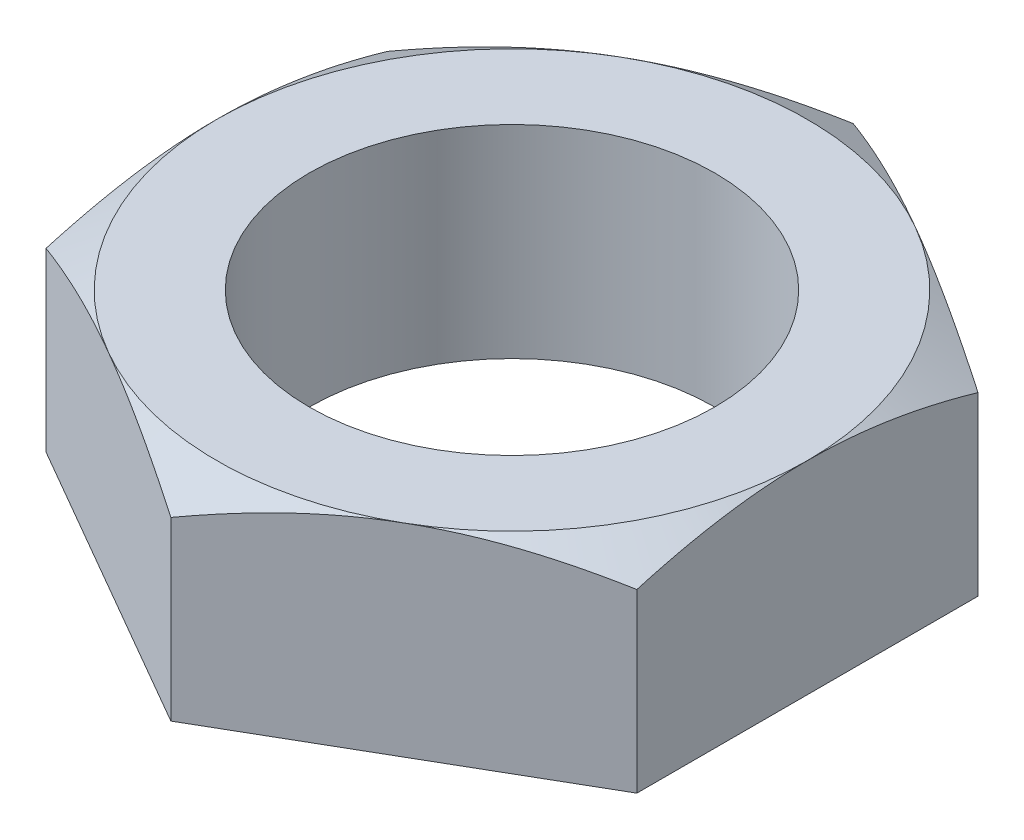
ISO-10303-21;
HEADER;
FILE_DESCRIPTION(('STEP AP214'),'2;1');
FILE_NAME('part.step','',(''),(''),'','','');
FILE_SCHEMA(('AUTOMOTIVE_DESIGN { 1 0 10303 214 1 1 1 1 }'));
ENDSEC;
DATA;
#1=APPLICATION_CONTEXT('core data for automotive mechanical design processes');
#2=APPLICATION_PROTOCOL_DEFINITION('international standard','automotive_design',2000,#1);
#3=PRODUCT_CONTEXT('',#1,'mechanical');
#4=PRODUCT('Part','Part','',(#3));
#5=PRODUCT_RELATED_PRODUCT_CATEGORY('part','',(#4));
#6=PRODUCT_DEFINITION_FORMATION('','',#4);
#7=PRODUCT_DEFINITION_CONTEXT('part definition',#1,'design');
#8=PRODUCT_DEFINITION('design','',#6,#7);
#9=PRODUCT_DEFINITION_SHAPE('','',#8);
#10=(LENGTH_UNIT() NAMED_UNIT(*) SI_UNIT(.MILLI.,.METRE.));
#11=(NAMED_UNIT(*) PLANE_ANGLE_UNIT() SI_UNIT($,.RADIAN.));
#12=(NAMED_UNIT(*) SI_UNIT($,.STERADIAN.) SOLID_ANGLE_UNIT());
#13=UNCERTAINTY_MEASURE_WITH_UNIT(LENGTH_MEASURE(1.E-05),#10,'distance_accuracy_value','');
#14=(GEOMETRIC_REPRESENTATION_CONTEXT(3) GLOBAL_UNCERTAINTY_ASSIGNED_CONTEXT((#13)) GLOBAL_UNIT_ASSIGNED_CONTEXT((#10,
#11,#12)) REPRESENTATION_CONTEXT('',''));
#15=CARTESIAN_POINT('',(0.,0.,0.));
#16=DIRECTION('',(0.,0.,1.));
#17=DIRECTION('',(1.,0.,0.));
#18=AXIS2_PLACEMENT_3D('',#15,#16,#17);
#19=CARTESIAN_POINT('',(0.,9.,-15.1418661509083));
#20=DIRECTION('',(0.,1.,0.));
#21=DIRECTION('',(0.,0.,1.));
#22=AXIS2_PLACEMENT_3D('',#19,#20,#21);
#23=PLANE('',#22);
#24=CARTESIAN_POINT('',(0.,9.,0.));
#25=DIRECTION('',(0.,1.,0.));
#26=DIRECTION('',(0.,0.,1.));
#27=AXIS2_PLACEMENT_3D('',#24,#25,#26);
#28=CIRCLE('',#27,9.);
#29=CARTESIAN_POINT('',(0.,9.,9.));
#30=VERTEX_POINT('',#29);
#31=EDGE_CURVE('E246',#30,#30,#28,.T.);
#32=ORIENTED_EDGE('',*,*,#31,.F.);
#33=EDGE_LOOP('',(#32));
#34=FACE_BOUND('',#33,.T.);
#35=CARTESIAN_POINT('',(0.,9.,0.));
#36=DIRECTION('',(0.,1.,0.));
#37=DIRECTION('',(0.,0.,1.));
#38=AXIS2_PLACEMENT_3D('',#35,#36,#37);
#39=CIRCLE('',#38,13.1132407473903);
#40=CARTESIAN_POINT('',(-6.55662037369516,9.,11.3563996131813));
#41=VERTEX_POINT('',#40);
#42=CARTESIAN_POINT('',(6.55662037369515,9.,11.3563996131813));
#43=VERTEX_POINT('',#42);
#44=EDGE_CURVE('E139',#41,#43,#39,.T.);
#45=ORIENTED_EDGE('',*,*,#44,.T.);
#46=CARTESIAN_POINT('',(13.1132407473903,9.,0.));
#47=VERTEX_POINT('',#46);
#48=EDGE_CURVE('E137',#43,#47,#39,.T.);
#49=ORIENTED_EDGE('',*,*,#48,.T.);
#50=CARTESIAN_POINT('',(6.55662037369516,9.,-11.3563996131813));
#51=VERTEX_POINT('',#50);
#52=EDGE_CURVE('E119',#47,#51,#39,.T.);
#53=ORIENTED_EDGE('',*,*,#52,.T.);
#54=CARTESIAN_POINT('',(-6.55662037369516,9.,-11.3563996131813));
#55=VERTEX_POINT('',#54);
#56=EDGE_CURVE('E109',#51,#55,#39,.T.);
#57=ORIENTED_EDGE('',*,*,#56,.T.);
#58=CARTESIAN_POINT('',(-13.1132407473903,9.,0.));
#59=VERTEX_POINT('',#58);
#60=EDGE_CURVE('E54',#55,#59,#39,.T.);
#61=ORIENTED_EDGE('',*,*,#60,.T.);
#62=EDGE_CURVE('E62',#59,#41,#39,.T.);
#63=ORIENTED_EDGE('',*,*,#62,.T.);
#64=EDGE_LOOP('',(#45,#49,#53,#57,#61,#63));
#65=FACE_BOUND('',#64,.T.);
#66=ADVANCED_FACE('F33',(#34,#65),#23,.T.);
#67=CARTESIAN_POINT('',(13.1132407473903,9.,-7.57093307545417));
#68=DIRECTION('',(-0.5,0.,0.866025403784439));
#69=DIRECTION('',(0.866025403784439,0.,0.5));
#70=AXIS2_PLACEMENT_3D('',#67,#68,#69);
#71=PLANE('',#70);
#72=CARTESIAN_POINT('',(13.1134407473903,7.82870590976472,-7.57081760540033));
#73=CARTESIAN_POINT('',(12.8252166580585,7.92477459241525,-7.73722386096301));
#74=CARTESIAN_POINT('',(12.5358683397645,8.0164838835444,-7.90427919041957));
#75=CARTESIAN_POINT('',(11.9548514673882,8.18997191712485,-8.23972943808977));
#76=CARTESIAN_POINT('',(11.6631821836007,8.27174739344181,-8.40812477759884));
#77=CARTESIAN_POINT('',(11.0769596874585,8.42426857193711,-8.74658049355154));
#78=CARTESIAN_POINT('',(10.7824013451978,8.4949881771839,-8.91664383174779));
#79=CARTESIAN_POINT('',(10.1912378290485,8.62387905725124,-9.25795224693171));
#80=CARTESIAN_POINT('',(9.89463277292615,8.68205104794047,-9.42919725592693));
#81=CARTESIAN_POINT('',(9.30697600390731,8.78337244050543,-9.76848104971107));
#82=CARTESIAN_POINT('',(9.01596791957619,8.82685719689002,-9.93649464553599));
#83=CARTESIAN_POINT('',(8.43261828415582,8.89977163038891,-10.2732917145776));
#84=CARTESIAN_POINT('',(8.14027670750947,8.92920103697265,-10.4420752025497));
#85=CARTESIAN_POINT('',(7.55510245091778,8.97326169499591,-10.7799257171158));
#86=CARTESIAN_POINT('',(7.2622707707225,8.9879105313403,-10.9489921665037));
#87=CARTESIAN_POINT('',(6.67633708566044,9.00209501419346,-11.2872811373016));
#88=CARTESIAN_POINT('',(6.38323508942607,9.00163112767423,-11.4565036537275));
#89=CARTESIAN_POINT('',(5.83528144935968,8.98664571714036,-11.7728648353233));
#90=CARTESIAN_POINT('',(5.58039075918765,8.97395205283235,-11.920026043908));
#91=CARTESIAN_POINT('',(5.07119568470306,8.93737473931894,-12.2140099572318));
#92=CARTESIAN_POINT('',(4.81689134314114,8.91349029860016,-12.3608326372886));
#93=CARTESIAN_POINT('',(4.30900709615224,8.85494787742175,-12.6540597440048));
#94=CARTESIAN_POINT('',(4.05542796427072,8.82028099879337,-12.8004637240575));
#95=CARTESIAN_POINT('',(3.54945853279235,8.74078193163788,-13.0925853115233));
#96=CARTESIAN_POINT('',(3.2970683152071,8.69594905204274,-13.2383028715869));
#97=CARTESIAN_POINT('',(2.53092371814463,8.54506809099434,-13.6806366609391));
#98=CARTESIAN_POINT('',(2.01938798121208,8.42397553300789,-13.9759719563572));
#99=CARTESIAN_POINT('',(1.00394418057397,8.14914487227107,-14.5622387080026));
#100=CARTESIAN_POINT('',(0.50002311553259,7.99547131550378,-14.8531776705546));
#101=CARTESIAN_POINT('',(-0.000199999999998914,7.82870590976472,-15.1419816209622));
#102=B_SPLINE_CURVE_WITH_KNOTS('',3,(#72,#73,#74,#75,#76,#77,#78,#79,#80,#81,#82,#83,#84,#85,
#86,#87,#88,#89,#90,#91,#92,#93,#94,#95,#96,#97,#98,#99,#100,#101),.UNSPECIFIED.,.F.,.F.,(4,2,2,
2,2,2,2,2,2,2,2,2,2,2,4),(0.,1.0392289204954,2.07879860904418,3.12078626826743,4.16271446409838,
5.17892532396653,6.19515574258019,7.2101756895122,8.22516427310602,9.1087393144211,
9.99237685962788,10.8767455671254,11.7611744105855,13.5689258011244,15.373128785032),.UNSPECIFIED.);
#103=CARTESIAN_POINT('',(13.1132407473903,7.82877257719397,-7.57093307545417));
#104=VERTEX_POINT('',#103);
#105=EDGE_CURVE('E124',#104,#51,#102,.T.);
#106=ORIENTED_EDGE('',*,*,#105,.F.);
#107=DIRECTION('',(0.,-1.,0.));
#108=VECTOR('',#107,1.);
#109=CARTESIAN_POINT('',(13.1132407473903,9.,-7.57093307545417));
#110=LINE('',#109,#108);
#111=CARTESIAN_POINT('',(13.1132407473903,0.,-7.57093307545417));
#112=VERTEX_POINT('',#111);
#113=EDGE_CURVE('E224',#104,#112,#110,.T.);
#114=ORIENTED_EDGE('',*,*,#113,.T.);
#115=DIRECTION('',(-0.866025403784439,0.,-0.5));
#116=VECTOR('',#115,1.);
#117=CARTESIAN_POINT('',(13.1132407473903,0.,-7.57093307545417));
#118=LINE('',#117,#116);
#119=CARTESIAN_POINT('',(0.,0.,-15.1418661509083));
#120=VERTEX_POINT('',#119);
#121=EDGE_CURVE('E241',#112,#120,#118,.T.);
#122=ORIENTED_EDGE('',*,*,#121,.T.);
#123=DIRECTION('',(0.,-1.,0.));
#124=VECTOR('',#123,1.);
#125=CARTESIAN_POINT('',(0.,9.,-15.1418661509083));
#126=LINE('',#125,#124);
#127=CARTESIAN_POINT('',(0.,7.82877257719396,-15.1418661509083));
#128=VERTEX_POINT('',#127);
#129=EDGE_CURVE('E133',#128,#120,#126,.T.);
#130=ORIENTED_EDGE('',*,*,#129,.F.);
#131=EDGE_CURVE('E113',#51,#128,#102,.T.);
#132=ORIENTED_EDGE('',*,*,#131,.F.);
#133=EDGE_LOOP('',(#106,#114,#122,#130,#132));
#134=FACE_BOUND('',#133,.T.);
#135=ADVANCED_FACE('F35',(#134),#71,.F.);
#136=CARTESIAN_POINT('',(0.,9.,-15.1418661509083));
#137=DIRECTION('',(0.5,0.,0.866025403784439));
#138=DIRECTION('',(0.866025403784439,0.,-0.5));
#139=AXIS2_PLACEMENT_3D('',#136,#137,#138);
#140=PLANE('',#139);
#141=CARTESIAN_POINT('',(0.000200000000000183,7.82870590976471,-15.1419816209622));
#142=CARTESIAN_POINT('',(-0.28802408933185,7.92477459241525,-14.9755753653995));
#143=CARTESIAN_POINT('',(-0.57737240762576,8.01648388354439,-14.8085200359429));
#144=CARTESIAN_POINT('',(-1.15838928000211,8.18997191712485,-14.4730697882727));
#145=CARTESIAN_POINT('',(-1.45005856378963,8.27174739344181,-14.3046744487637));
#146=CARTESIAN_POINT('',(-2.03628105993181,8.42426857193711,-13.966218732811));
#147=CARTESIAN_POINT('',(-2.33083940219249,8.4949881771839,-13.7961553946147));
#148=CARTESIAN_POINT('',(-2.92200291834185,8.62387905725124,-13.4548469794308));
#149=CARTESIAN_POINT('',(-3.21860797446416,8.68205104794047,-13.2836019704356));
#150=CARTESIAN_POINT('',(-3.80626474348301,8.78337244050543,-12.9443181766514));
#151=CARTESIAN_POINT('',(-4.09727282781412,8.82685719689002,-12.7763045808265));
#152=CARTESIAN_POINT('',(-4.68062246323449,8.89977163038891,-12.4395075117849));
#153=CARTESIAN_POINT('',(-4.97296403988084,8.92920103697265,-12.2707240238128));
#154=CARTESIAN_POINT('',(-5.55813829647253,8.97326169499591,-11.9328735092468));
#155=CARTESIAN_POINT('',(-5.85096997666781,8.9879105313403,-11.7638070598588));
#156=CARTESIAN_POINT('',(-6.43690366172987,9.00209501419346,-11.4255180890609));
#157=CARTESIAN_POINT('',(-6.73000565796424,9.00163112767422,-11.256295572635));
#158=CARTESIAN_POINT('',(-7.27795929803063,8.98664571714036,-10.9399343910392));
#159=CARTESIAN_POINT('',(-7.53284998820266,8.97395205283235,-10.7927731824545));
#160=CARTESIAN_POINT('',(-8.04204506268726,8.93737473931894,-10.4987892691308));
#161=CARTESIAN_POINT('',(-8.29634940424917,8.91349029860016,-10.3519665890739));
#162=CARTESIAN_POINT('',(-8.80423365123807,8.85494787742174,-10.0587394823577));
#163=CARTESIAN_POINT('',(-9.05781278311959,8.82028099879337,-9.91233550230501));
#164=CARTESIAN_POINT('',(-9.56378221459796,8.74078193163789,-9.62021391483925));
#165=CARTESIAN_POINT('',(-9.81617243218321,8.69594905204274,-9.47449635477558));
#166=CARTESIAN_POINT('',(-10.5823170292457,8.54506809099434,-9.03216256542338));
#167=CARTESIAN_POINT('',(-11.0938527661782,8.42397553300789,-8.73682727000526));
#168=CARTESIAN_POINT('',(-12.1092965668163,8.14914487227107,-8.15056051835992));
#169=CARTESIAN_POINT('',(-12.6132176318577,7.99547131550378,-7.85962155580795));
#170=CARTESIAN_POINT('',(-13.1134407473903,7.82870590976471,-7.57081760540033));
#171=B_SPLINE_CURVE_WITH_KNOTS('',3,(#141,#142,#143,#144,#145,#146,#147,#148,#149,#150,#151,
#152,#153,#154,#155,#156,#157,#158,#159,#160,#161,#162,#163,#164,#165,#166,#167,#168,#169,#170),
.UNSPECIFIED.,.F.,.F.,(4,2,2,2,2,2,2,2,2,2,2,2,2,2,4),(0.,1.0392289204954,2.07879860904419,
3.12078626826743,4.16271446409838,5.17892532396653,6.1951557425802,7.2101756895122,
8.22516427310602,9.10873931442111,9.99237685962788,10.8767455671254,11.7611744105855,
13.5689258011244,15.373128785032),.UNSPECIFIED.);
#172=EDGE_CURVE('E115',#128,#55,#171,.T.);
#173=ORIENTED_EDGE('',*,*,#172,.F.);
#174=ORIENTED_EDGE('',*,*,#129,.T.);
#175=DIRECTION('',(-0.866025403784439,0.,0.5));
#176=VECTOR('',#175,1.);
#177=CARTESIAN_POINT('',(0.,0.,-15.1418661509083));
#178=LINE('',#177,#176);
#179=CARTESIAN_POINT('',(-13.1132407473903,0.,-7.57093307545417));
#180=VERTEX_POINT('',#179);
#181=EDGE_CURVE('E237',#120,#180,#178,.T.);
#182=ORIENTED_EDGE('',*,*,#181,.T.);
#183=DIRECTION('',(0.,-1.,0.));
#184=VECTOR('',#183,1.);
#185=CARTESIAN_POINT('',(-13.1132407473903,9.,-7.57093307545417));
#186=LINE('',#185,#184);
#187=CARTESIAN_POINT('',(-13.1132407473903,7.82877257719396,-7.57093307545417));
#188=VERTEX_POINT('',#187);
#189=EDGE_CURVE('E233',#188,#180,#186,.T.);
#190=ORIENTED_EDGE('',*,*,#189,.F.);
#191=EDGE_CURVE('E178',#55,#188,#171,.T.);
#192=ORIENTED_EDGE('',*,*,#191,.F.);
#193=EDGE_LOOP('',(#173,#174,#182,#190,#192));
#194=FACE_BOUND('',#193,.T.);
#195=ADVANCED_FACE('F186',(#194),#140,.F.);
#196=CARTESIAN_POINT('',(-13.1132407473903,9.,-7.57093307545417));
#197=DIRECTION('',(1.,0.,0.));
#198=DIRECTION('',(0.,0.,-1.));
#199=AXIS2_PLACEMENT_3D('',#196,#197,#198);
#200=PLANE('',#199);
#201=CARTESIAN_POINT('',(-13.1132407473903,2.46488154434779,-20.6151639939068));
#202=CARTESIAN_POINT('',(-13.1132407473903,2.60495891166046,-20.3276120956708));
#203=CARTESIAN_POINT('',(-13.1132407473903,2.74435857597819,-20.0397302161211));
#204=CARTESIAN_POINT('',(-13.1132407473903,3.02164954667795,-19.4632377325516));
#205=CARTESIAN_POINT('',(-13.1132407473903,3.15954083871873,-19.1746271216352));
#206=CARTESIAN_POINT('',(-13.1132407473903,3.570757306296,-18.307525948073));
#207=CARTESIAN_POINT('',(-13.1132407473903,3.84158557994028,-17.7278469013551));
#208=CARTESIAN_POINT('',(-13.1132407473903,4.37639735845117,-16.5616782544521));
#209=CARTESIAN_POINT('',(-13.1132407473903,4.64033791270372,-15.9751689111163));
#210=CARTESIAN_POINT('',(-13.1132407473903,5.15778839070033,-14.7975826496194));
#211=CARTESIAN_POINT('',(-13.1132407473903,5.41129878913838,-14.2065059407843));
#212=CARTESIAN_POINT('',(-13.1132407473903,5.91351685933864,-12.998694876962));
#213=CARTESIAN_POINT('',(-13.1132407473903,6.16176970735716,-12.3817704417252));
#214=CARTESIAN_POINT('',(-13.1132407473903,6.64015376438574,-11.1408032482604));
#215=CARTESIAN_POINT('',(-13.1132407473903,6.87028297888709,-10.5167597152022));
#216=CARTESIAN_POINT('',(-13.1132407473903,7.30657769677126,-9.26166204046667));
#217=CARTESIAN_POINT('',(-13.1132407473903,7.51278940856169,-8.63062408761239));
#218=CARTESIAN_POINT('',(-13.1132407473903,7.89482998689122,-7.35944134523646));
#219=CARTESIAN_POINT('',(-13.1132407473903,8.07066813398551,-6.71929940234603));
#220=CARTESIAN_POINT('',(-13.1132407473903,8.30493536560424,-5.75391772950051));
#221=CARTESIAN_POINT('',(-13.1132407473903,8.37794127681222,-5.43219571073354));
#222=CARTESIAN_POINT('',(-13.1132407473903,8.51328240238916,-4.78650335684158));
#223=CARTESIAN_POINT('',(-13.1132407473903,8.57561782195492,-4.46253306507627));
#224=CARTESIAN_POINT('',(-13.1132407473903,8.68853555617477,-3.81254743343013));
#225=CARTESIAN_POINT('',(-13.1132407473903,8.73911812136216,-3.48653213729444));
#226=CARTESIAN_POINT('',(-13.1132407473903,8.82753247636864,-2.83277850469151));
#227=CARTESIAN_POINT('',(-13.1132407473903,8.86536478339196,-2.50504023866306));
#228=CARTESIAN_POINT('',(-13.1132407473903,8.92703670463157,-1.85269819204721));
#229=CARTESIAN_POINT('',(-13.1132407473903,8.9510580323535,-1.52811169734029));
#230=CARTESIAN_POINT('',(-13.1132407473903,8.98534054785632,-0.878213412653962));
#231=CARTESIAN_POINT('',(-13.1132407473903,8.99560197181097,-0.552901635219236));
#232=CARTESIAN_POINT('',(-13.1132407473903,9.00211910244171,0.0978645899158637));
#233=CARTESIAN_POINT('',(-13.1132407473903,8.99837483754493,0.423319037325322));
#234=CARTESIAN_POINT('',(-13.1132407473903,8.97697536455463,1.07377364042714));
#235=CARTESIAN_POINT('',(-13.1132407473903,8.95931952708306,1.39877377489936));
#236=CARTESIAN_POINT('',(-13.1132407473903,8.90117737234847,2.17156974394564));
#237=CARTESIAN_POINT('',(-13.1132407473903,8.85455114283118,2.61891417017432));
#238=CARTESIAN_POINT('',(-13.1132407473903,8.73742387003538,3.51044237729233));
#239=CARTESIAN_POINT('',(-13.1132407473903,8.6669198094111,3.95462575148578));
#240=CARTESIAN_POINT('',(-13.1132407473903,8.4233158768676,5.28183843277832));
#241=CARTESIAN_POINT('',(-13.1132407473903,8.21816349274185,6.15907150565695));
#242=CARTESIAN_POINT('',(-13.1132407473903,7.86037554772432,7.47112752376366));
#243=CARTESIAN_POINT('',(-13.1132407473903,7.73105247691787,7.91270092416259));
#244=CARTESIAN_POINT('',(-13.1132407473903,7.45846171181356,8.79156473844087));
#245=CARTESIAN_POINT('',(-13.1132407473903,7.31519391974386,9.22885512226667));
#246=CARTESIAN_POINT('',(-13.1132407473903,7.01705454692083,10.0992803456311));
#247=CARTESIAN_POINT('',(-13.1132407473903,6.86218641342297,10.5324163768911));
#248=CARTESIAN_POINT('',(-13.1132407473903,6.54271936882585,11.3950659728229));
#249=CARTESIAN_POINT('',(-13.1132407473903,6.37812060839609,11.8245795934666));
#250=CARTESIAN_POINT('',(-13.1132407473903,5.9593098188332,12.8871259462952));
#251=CARTESIAN_POINT('',(-13.1132407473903,5.70022148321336,13.5182337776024));
#252=CARTESIAN_POINT('',(-13.1132407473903,5.1682372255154,14.7746223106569));
#253=CARTESIAN_POINT('',(-13.1132407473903,4.89534021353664,15.3999025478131));
#254=CARTESIAN_POINT('',(-13.1132407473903,4.33867706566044,16.6458051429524));
#255=CARTESIAN_POINT('',(-13.1132407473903,4.05490785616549,17.2664261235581));
#256=CARTESIAN_POINT('',(-13.1132407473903,3.47883713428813,18.5036630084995));
#257=CARTESIAN_POINT('',(-13.1132407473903,3.18653586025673,19.1202790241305));
#258=CARTESIAN_POINT('',(-13.1132407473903,2.59470476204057,20.3510163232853));
#259=CARTESIAN_POINT('',(-13.1132407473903,2.29516600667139,20.9651333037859));
#260=CARTESIAN_POINT('',(-13.1132407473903,1.69052532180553,22.1906225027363));
#261=CARTESIAN_POINT('',(-13.1132407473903,1.38542336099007,22.8019947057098));
#262=CARTESIAN_POINT('',(-13.1132407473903,0.77071126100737,24.0223402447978));
#263=CARTESIAN_POINT('',(-13.1132407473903,0.461101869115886,24.6313139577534));
#264=CARTESIAN_POINT('',(-13.1132407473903,-0.161897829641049,25.8473254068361));
#265=CARTESIAN_POINT('',(-13.1132407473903,-0.475288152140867,26.4543631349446));
#266=CARTESIAN_POINT('',(-13.1132407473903,-1.36234027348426,28.1616978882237));
#267=CARTESIAN_POINT('',(-13.1132407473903,-1.93961999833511,29.260115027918));
#268=CARTESIAN_POINT('',(-13.1132407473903,-3.10185532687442,31.4529343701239));
#269=CARTESIAN_POINT('',(-13.1132407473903,-3.68681127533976,32.5473363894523));
#270=CARTESIAN_POINT('',(-13.1132407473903,-4.86084522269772,34.7298556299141));
#271=CARTESIAN_POINT('',(-13.1132407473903,-5.44990646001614,35.817981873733));
#272=CARTESIAN_POINT('',(-13.1132407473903,-6.33684881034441,37.4483010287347));
#273=CARTESIAN_POINT('',(-13.1132407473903,-6.63304520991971,37.9914118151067));
#274=CARTESIAN_POINT('',(-13.1132407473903,-7.22644109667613,39.0770841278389));
#275=CARTESIAN_POINT('',(-13.1132407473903,-7.52364058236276,39.6196456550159));
#276=CARTESIAN_POINT('',(-13.1132407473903,-7.82128212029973,40.1619646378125));
#277=B_SPLINE_CURVE_WITH_KNOTS('',3,(#201,#202,#203,#204,#205,#206,#207,#208,#209,#210,#211,
#212,#213,#214,#215,#216,#217,#218,#219,#220,#221,#222,#223,#224,#225,#226,#227,#228,#229,#230,
#231,#232,#233,#234,#235,#236,#237,#238,#239,#240,#241,#242,#243,#244,#245,#246,#247,#248,#249,
#250,#251,#252,#253,#254,#255,#256,#257,#258,#259,#260,#261,#262,#263,#264,#265,#266,#267,#268,
#269,#270,#271,#272,#273,#274,#275,#276),.UNSPECIFIED.,.F.,.F.,(4,2,2,2,2,2,2,2,2,2,2,2,2,2,2,2,
2,2,2,2,2,2,2,2,2,2,2,2,2,2,2,2,2,2,2,2,2,4),(0.,0.95956589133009,1.91914089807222,
3.8385608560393,5.76796867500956,7.69728858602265,9.69207160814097,11.6870738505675,
13.678155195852,15.6686270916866,16.658182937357,17.6477197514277,18.6372354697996,
19.6267110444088,20.6028510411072,21.5789742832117,22.5550955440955,23.53126096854,
24.8798079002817,26.2285253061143,28.9273352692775,30.3075761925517,31.6878267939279,
33.0676688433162,34.4474895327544,36.4939191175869,38.5405104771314,40.5876847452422,
42.6348018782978,44.6845891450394,46.7343879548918,48.783850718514,50.8333219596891,
54.5559020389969,58.2786498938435,61.990657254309,63.8465429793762,65.702425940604),.UNSPECIFIED.);
#278=EDGE_CURVE('E176',#188,#59,#277,.T.);
#279=ORIENTED_EDGE('',*,*,#278,.F.);
#280=ORIENTED_EDGE('',*,*,#189,.T.);
#281=DIRECTION('',(0.,0.,1.));
#282=VECTOR('',#281,1.);
#283=CARTESIAN_POINT('',(-13.1132407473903,0.,-7.57093307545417));
#284=LINE('',#283,#282);
#285=CARTESIAN_POINT('',(-13.1132407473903,0.,7.57093307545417));
#286=VERTEX_POINT('',#285);
#287=EDGE_CURVE('E244',#180,#286,#284,.T.);
#288=ORIENTED_EDGE('',*,*,#287,.T.);
#289=DIRECTION('',(0.,-1.,0.));
#290=VECTOR('',#289,1.);
#291=CARTESIAN_POINT('',(-13.1132407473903,9.,7.57093307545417));
#292=LINE('',#291,#290);
#293=CARTESIAN_POINT('',(-13.1132407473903,7.82877257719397,7.57093307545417));
#294=VERTEX_POINT('',#293);
#295=EDGE_CURVE('E226',#294,#286,#292,.T.);
#296=ORIENTED_EDGE('',*,*,#295,.F.);
#297=EDGE_CURVE('E171',#59,#294,#277,.T.);
#298=ORIENTED_EDGE('',*,*,#297,.F.);
#299=EDGE_LOOP('',(#279,#280,#288,#296,#298));
#300=FACE_BOUND('',#299,.T.);
#301=ADVANCED_FACE('F182',(#300),#200,.F.);
#302=CARTESIAN_POINT('',(-13.1132407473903,9.,7.57093307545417));
#303=DIRECTION('',(0.5,0.,-0.866025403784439));
#304=DIRECTION('',(-0.866025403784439,0.,-0.5));
#305=AXIS2_PLACEMENT_3D('',#302,#303,#304);
#306=PLANE('',#305);
#307=CARTESIAN_POINT('',(-13.1134407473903,7.82870590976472,7.57081760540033));
#308=CARTESIAN_POINT('',(-12.8252166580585,7.92477459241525,7.73722386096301));
#309=CARTESIAN_POINT('',(-12.5358683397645,8.01648388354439,7.90427919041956));
#310=CARTESIAN_POINT('',(-11.9548514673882,8.18997191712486,8.23972943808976));
#311=CARTESIAN_POINT('',(-11.6631821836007,8.27174739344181,8.40812477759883));
#312=CARTESIAN_POINT('',(-11.0769596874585,8.42426857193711,8.74658049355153));
#313=CARTESIAN_POINT('',(-10.7824013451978,8.4949881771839,8.91664383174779));
#314=CARTESIAN_POINT('',(-10.1912378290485,8.62387905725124,9.25795224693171));
#315=CARTESIAN_POINT('',(-9.89463277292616,8.68205104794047,9.42919725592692));
#316=CARTESIAN_POINT('',(-9.30697600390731,8.78337244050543,9.76848104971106));
#317=CARTESIAN_POINT('',(-9.0159679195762,8.82685719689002,9.93649464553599));
#318=CARTESIAN_POINT('',(-8.43261828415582,8.89977163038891,10.2732917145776));
#319=CARTESIAN_POINT('',(-8.14027670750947,8.92920103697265,10.4420752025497));
#320=CARTESIAN_POINT('',(-7.55510245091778,8.97326169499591,10.7799257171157));
#321=CARTESIAN_POINT('',(-7.26227077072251,8.9879105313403,10.9489921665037));
#322=CARTESIAN_POINT('',(-6.67633708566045,9.00209501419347,11.2872811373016));
#323=CARTESIAN_POINT('',(-6.38323508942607,9.00163112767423,11.4565036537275));
#324=CARTESIAN_POINT('',(-5.83528144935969,8.98664571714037,11.7728648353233));
#325=CARTESIAN_POINT('',(-5.58039075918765,8.97395205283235,11.920026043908));
#326=CARTESIAN_POINT('',(-5.07119568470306,8.93737473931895,12.2140099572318));
#327=CARTESIAN_POINT('',(-4.81689134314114,8.91349029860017,12.3608326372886));
#328=CARTESIAN_POINT('',(-4.30900709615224,8.85494787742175,12.6540597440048));
#329=CARTESIAN_POINT('',(-4.05542796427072,8.82028099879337,12.8004637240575));
#330=CARTESIAN_POINT('',(-3.54945853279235,8.74078193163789,13.0925853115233));
#331=CARTESIAN_POINT('',(-3.2970683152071,8.69594905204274,13.2383028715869));
#332=CARTESIAN_POINT('',(-2.53092371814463,8.54506809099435,13.6806366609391));
#333=CARTESIAN_POINT('',(-2.01938798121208,8.4239755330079,13.9759719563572));
#334=CARTESIAN_POINT('',(-1.00394418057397,8.14914487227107,14.5622387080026));
#335=CARTESIAN_POINT('',(-0.50002311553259,7.99547131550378,14.8531776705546));
#336=CARTESIAN_POINT('',(0.000200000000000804,7.82870590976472,15.1419816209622));
#337=B_SPLINE_CURVE_WITH_KNOTS('',3,(#307,#308,#309,#310,#311,#312,#313,#314,#315,#316,#317,
#318,#319,#320,#321,#322,#323,#324,#325,#326,#327,#328,#329,#330,#331,#332,#333,#334,#335,#336),
.UNSPECIFIED.,.F.,.F.,(4,2,2,2,2,2,2,2,2,2,2,2,2,2,4),(0.,1.0392289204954,2.07879860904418,
3.12078626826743,4.16271446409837,5.17892532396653,6.19515574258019,7.2101756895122,
8.22516427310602,9.10873931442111,9.99237685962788,10.8767455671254,11.7611744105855,
13.5689258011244,15.373128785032),.UNSPECIFIED.);
#338=EDGE_CURVE('E177',#294,#41,#337,.T.);
#339=ORIENTED_EDGE('',*,*,#338,.F.);
#340=ORIENTED_EDGE('',*,*,#295,.T.);
#341=DIRECTION('',(0.866025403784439,0.,0.5));
#342=VECTOR('',#341,1.);
#343=CARTESIAN_POINT('',(-13.1132407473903,0.,7.57093307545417));
#344=LINE('',#343,#342);
#345=CARTESIAN_POINT('',(0.,0.,15.1418661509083));
#346=VERTEX_POINT('',#345);
#347=EDGE_CURVE('E252',#286,#346,#344,.T.);
#348=ORIENTED_EDGE('',*,*,#347,.T.);
#349=DIRECTION('',(0.,-1.,0.));
#350=VECTOR('',#349,1.);
#351=CARTESIAN_POINT('',(0.,9.,15.1418661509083));
#352=LINE('',#351,#350);
#353=CARTESIAN_POINT('',(0.,7.82877257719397,15.1418661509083));
#354=VERTEX_POINT('',#353);
#355=EDGE_CURVE('E223',#354,#346,#352,.T.);
#356=ORIENTED_EDGE('',*,*,#355,.F.);
#357=EDGE_CURVE('E147',#41,#354,#337,.T.);
#358=ORIENTED_EDGE('',*,*,#357,.F.);
#359=EDGE_LOOP('',(#339,#340,#348,#356,#358));
#360=FACE_BOUND('',#359,.T.);
#361=ADVANCED_FACE('F185',(#360),#306,.F.);
#362=CARTESIAN_POINT('',(0.,9.,15.1418661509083));
#363=DIRECTION('',(-0.5,0.,-0.866025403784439));
#364=DIRECTION('',(-0.866025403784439,0.,0.5));
#365=AXIS2_PLACEMENT_3D('',#362,#363,#364);
#366=PLANE('',#365);
#367=CARTESIAN_POINT('',(-0.000200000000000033,7.82870590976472,15.1419816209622));
#368=CARTESIAN_POINT('',(0.28802408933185,7.92477459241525,14.9755753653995));
#369=CARTESIAN_POINT('',(0.57737240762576,8.01648388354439,14.8085200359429));
#370=CARTESIAN_POINT('',(1.15838928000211,8.18997191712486,14.4730697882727));
#371=CARTESIAN_POINT('',(1.45005856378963,8.27174739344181,14.3046744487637));
#372=CARTESIAN_POINT('',(2.03628105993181,8.42426857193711,13.966218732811));
#373=CARTESIAN_POINT('',(2.33083940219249,8.4949881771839,13.7961553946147));
#374=CARTESIAN_POINT('',(2.92200291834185,8.62387905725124,13.4548469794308));
#375=CARTESIAN_POINT('',(3.21860797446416,8.68205104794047,13.2836019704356));
#376=CARTESIAN_POINT('',(3.806264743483,8.78337244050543,12.9443181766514));
#377=CARTESIAN_POINT('',(4.09727282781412,8.82685719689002,12.7763045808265));
#378=CARTESIAN_POINT('',(4.68062246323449,8.89977163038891,12.4395075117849));
#379=CARTESIAN_POINT('',(4.97296403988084,8.92920103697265,12.2707240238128));
#380=CARTESIAN_POINT('',(5.55813829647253,8.97326169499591,11.9328735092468));
#381=CARTESIAN_POINT('',(5.8509699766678,8.9879105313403,11.7638070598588));
#382=CARTESIAN_POINT('',(6.43690366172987,9.00209501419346,11.4255180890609));
#383=CARTESIAN_POINT('',(6.73000565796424,9.00163112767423,11.256295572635));
#384=CARTESIAN_POINT('',(7.27795929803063,8.98664571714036,10.9399343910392));
#385=CARTESIAN_POINT('',(7.53284998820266,8.97395205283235,10.7927731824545));
#386=CARTESIAN_POINT('',(8.04204506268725,8.93737473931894,10.4987892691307));
#387=CARTESIAN_POINT('',(8.29634940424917,8.91349029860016,10.3519665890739));
#388=CARTESIAN_POINT('',(8.80423365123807,8.85494787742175,10.0587394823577));
#389=CARTESIAN_POINT('',(9.05781278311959,8.82028099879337,9.91233550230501));
#390=CARTESIAN_POINT('',(9.56378221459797,8.74078193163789,9.62021391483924));
#391=CARTESIAN_POINT('',(9.81617243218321,8.69594905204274,9.47449635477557));
#392=CARTESIAN_POINT('',(10.5823170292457,8.54506809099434,9.03216256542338));
#393=CARTESIAN_POINT('',(11.0938527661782,8.42397553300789,8.73682727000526));
#394=CARTESIAN_POINT('',(12.1092965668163,8.14914487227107,8.15056051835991));
#395=CARTESIAN_POINT('',(12.6132176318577,7.99547131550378,7.85962155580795));
#396=CARTESIAN_POINT('',(13.1134407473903,7.82870590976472,7.57081760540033));
#397=B_SPLINE_CURVE_WITH_KNOTS('',3,(#367,#368,#369,#370,#371,#372,#373,#374,#375,#376,#377,
#378,#379,#380,#381,#382,#383,#384,#385,#386,#387,#388,#389,#390,#391,#392,#393,#394,#395,#396),
.UNSPECIFIED.,.F.,.F.,(4,2,2,2,2,2,2,2,2,2,2,2,2,2,4),(0.,1.0392289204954,2.07879860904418,
3.12078626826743,4.16271446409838,5.17892532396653,6.19515574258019,7.21017568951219,
8.22516427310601,9.10873931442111,9.99237685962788,10.8767455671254,11.7611744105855,
13.5689258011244,15.373128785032),.UNSPECIFIED.);
#398=EDGE_CURVE('E146',#354,#43,#397,.T.);
#399=ORIENTED_EDGE('',*,*,#398,.F.);
#400=ORIENTED_EDGE('',*,*,#355,.T.);
#401=DIRECTION('',(0.866025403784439,0.,-0.5));
#402=VECTOR('',#401,1.);
#403=CARTESIAN_POINT('',(0.,0.,15.1418661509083));
#404=LINE('',#403,#402);
#405=CARTESIAN_POINT('',(13.1132407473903,0.,7.57093307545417));
#406=VERTEX_POINT('',#405);
#407=EDGE_CURVE('E221',#346,#406,#404,.T.);
#408=ORIENTED_EDGE('',*,*,#407,.T.);
#409=DIRECTION('',(0.,-1.,0.));
#410=VECTOR('',#409,1.);
#411=CARTESIAN_POINT('',(13.1132407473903,9.,7.57093307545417));
#412=LINE('',#411,#410);
#413=CARTESIAN_POINT('',(13.1132407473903,7.82877257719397,7.57093307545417));
#414=VERTEX_POINT('',#413);
#415=EDGE_CURVE('E215',#414,#406,#412,.T.);
#416=ORIENTED_EDGE('',*,*,#415,.F.);
#417=EDGE_CURVE('E138',#43,#414,#397,.T.);
#418=ORIENTED_EDGE('',*,*,#417,.F.);
#419=EDGE_LOOP('',(#399,#400,#408,#416,#418));
#420=FACE_BOUND('',#419,.T.);
#421=ADVANCED_FACE('F153',(#420),#366,.F.);
#422=CARTESIAN_POINT('',(13.1132407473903,9.,7.57093307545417));
#423=DIRECTION('',(-1.,0.,0.));
#424=DIRECTION('',(0.,0.,1.));
#425=AXIS2_PLACEMENT_3D('',#422,#423,#424);
#426=PLANE('',#425);
#427=CARTESIAN_POINT('',(13.1132407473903,2.46488154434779,-20.6151639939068));
#428=CARTESIAN_POINT('',(13.1132407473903,2.60495891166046,-20.3276120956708));
#429=CARTESIAN_POINT('',(13.1132407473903,2.74435857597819,-20.0397302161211));
#430=CARTESIAN_POINT('',(13.1132407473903,3.02164954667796,-19.4632377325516));
#431=CARTESIAN_POINT('',(13.1132407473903,3.15954083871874,-19.1746271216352));
#432=CARTESIAN_POINT('',(13.1132407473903,3.57075730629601,-18.307525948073));
#433=CARTESIAN_POINT('',(13.1132407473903,3.84158557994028,-17.7278469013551));
#434=CARTESIAN_POINT('',(13.1132407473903,4.37639735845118,-16.5616782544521));
#435=CARTESIAN_POINT('',(13.1132407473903,4.64033791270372,-15.9751689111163));
#436=CARTESIAN_POINT('',(13.1132407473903,5.15778839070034,-14.7975826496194));
#437=CARTESIAN_POINT('',(13.1132407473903,5.41129878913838,-14.2065059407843));
#438=CARTESIAN_POINT('',(13.1132407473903,5.91351685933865,-12.998694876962));
#439=CARTESIAN_POINT('',(13.1132407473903,6.16176970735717,-12.3817704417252));
#440=CARTESIAN_POINT('',(13.1132407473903,6.64015376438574,-11.1408032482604));
#441=CARTESIAN_POINT('',(13.1132407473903,6.87028297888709,-10.5167597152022));
#442=CARTESIAN_POINT('',(13.1132407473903,7.30657769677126,-9.26166204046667));
#443=CARTESIAN_POINT('',(13.1132407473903,7.51278940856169,-8.63062408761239));
#444=CARTESIAN_POINT('',(13.1132407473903,7.89482998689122,-7.35944134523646));
#445=CARTESIAN_POINT('',(13.1132407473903,8.07066813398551,-6.71929940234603));
#446=CARTESIAN_POINT('',(13.1132407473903,8.30493536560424,-5.75391772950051));
#447=CARTESIAN_POINT('',(13.1132407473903,8.37794127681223,-5.43219571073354));
#448=CARTESIAN_POINT('',(13.1132407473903,8.51328240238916,-4.78650335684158));
#449=CARTESIAN_POINT('',(13.1132407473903,8.57561782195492,-4.46253306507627));
#450=CARTESIAN_POINT('',(13.1132407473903,8.68853555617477,-3.81254743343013));
#451=CARTESIAN_POINT('',(13.1132407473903,8.73911812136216,-3.48653213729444));
#452=CARTESIAN_POINT('',(13.1132407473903,8.82753247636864,-2.83277850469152));
#453=CARTESIAN_POINT('',(13.1132407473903,8.86536478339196,-2.50504023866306));
#454=CARTESIAN_POINT('',(13.1132407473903,8.92703670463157,-1.85269819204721));
#455=CARTESIAN_POINT('',(13.1132407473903,8.9510580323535,-1.5281116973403));
#456=CARTESIAN_POINT('',(13.1132407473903,8.98534054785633,-0.878213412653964));
#457=CARTESIAN_POINT('',(13.1132407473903,8.99560197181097,-0.552901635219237));
#458=CARTESIAN_POINT('',(13.1132407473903,9.00211910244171,0.0978645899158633));
#459=CARTESIAN_POINT('',(13.1132407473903,8.99837483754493,0.423319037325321));
#460=CARTESIAN_POINT('',(13.1132407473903,8.97697536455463,1.07377364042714));
#461=CARTESIAN_POINT('',(13.1132407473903,8.95931952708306,1.39877377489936));
#462=CARTESIAN_POINT('',(13.1132407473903,8.90117737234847,2.17156974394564));
#463=CARTESIAN_POINT('',(13.1132407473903,8.85455114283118,2.61891417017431));
#464=CARTESIAN_POINT('',(13.1132407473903,8.73742387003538,3.51044237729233));
#465=CARTESIAN_POINT('',(13.1132407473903,8.6669198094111,3.95462575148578));
#466=CARTESIAN_POINT('',(13.1132407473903,8.4233158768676,5.28183843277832));
#467=CARTESIAN_POINT('',(13.1132407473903,8.21816349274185,6.15907150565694));
#468=CARTESIAN_POINT('',(13.1132407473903,7.86037554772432,7.47112752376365));
#469=CARTESIAN_POINT('',(13.1132407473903,7.73105247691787,7.91270092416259));
#470=CARTESIAN_POINT('',(13.1132407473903,7.45846171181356,8.79156473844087));
#471=CARTESIAN_POINT('',(13.1132407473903,7.31519391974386,9.22885512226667));
#472=CARTESIAN_POINT('',(13.1132407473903,7.01705454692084,10.0992803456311));
#473=CARTESIAN_POINT('',(13.1132407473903,6.86218641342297,10.5324163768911));
#474=CARTESIAN_POINT('',(13.1132407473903,6.54271936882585,11.3950659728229));
#475=CARTESIAN_POINT('',(13.1132407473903,6.37812060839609,11.8245795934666));
#476=CARTESIAN_POINT('',(13.1132407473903,5.9593098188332,12.8871259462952));
#477=CARTESIAN_POINT('',(13.1132407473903,5.70022148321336,13.5182337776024));
#478=CARTESIAN_POINT('',(13.1132407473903,5.1682372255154,14.7746223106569));
#479=CARTESIAN_POINT('',(13.1132407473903,4.89534021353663,15.3999025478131));
#480=CARTESIAN_POINT('',(13.1132407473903,4.33867706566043,16.6458051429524));
#481=CARTESIAN_POINT('',(13.1132407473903,4.05490785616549,17.2664261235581));
#482=CARTESIAN_POINT('',(13.1132407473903,3.47883713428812,18.5036630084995));
#483=CARTESIAN_POINT('',(13.1132407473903,3.18653586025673,19.1202790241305));
#484=CARTESIAN_POINT('',(13.1132407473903,2.59470476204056,20.3510163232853));
#485=CARTESIAN_POINT('',(13.1132407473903,2.29516600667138,20.965133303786));
#486=CARTESIAN_POINT('',(13.1132407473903,1.69052532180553,22.1906225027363));
#487=CARTESIAN_POINT('',(13.1132407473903,1.38542336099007,22.8019947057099));
#488=CARTESIAN_POINT('',(13.1132407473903,0.770711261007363,24.0223402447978));
#489=CARTESIAN_POINT('',(13.1132407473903,0.461101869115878,24.6313139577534));
#490=CARTESIAN_POINT('',(13.1132407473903,-0.161897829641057,25.8473254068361));
#491=CARTESIAN_POINT('',(13.1132407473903,-0.475288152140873,26.4543631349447));
#492=CARTESIAN_POINT('',(13.1132407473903,-1.36234027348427,28.1616978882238));
#493=CARTESIAN_POINT('',(13.1132407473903,-1.93961999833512,29.2601150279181));
#494=CARTESIAN_POINT('',(13.1132407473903,-3.10185532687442,31.4529343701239));
#495=CARTESIAN_POINT('',(13.1132407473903,-3.68681127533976,32.5473363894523));
#496=CARTESIAN_POINT('',(13.1132407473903,-4.86084522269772,34.7298556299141));
#497=CARTESIAN_POINT('',(13.1132407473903,-5.44990646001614,35.8179818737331));
#498=CARTESIAN_POINT('',(13.1132407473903,-6.33684881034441,37.4483010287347));
#499=CARTESIAN_POINT('',(13.1132407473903,-6.63304520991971,37.9914118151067));
#500=CARTESIAN_POINT('',(13.1132407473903,-7.22644109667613,39.0770841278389));
#501=CARTESIAN_POINT('',(13.1132407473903,-7.52364058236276,39.6196456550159));
#502=CARTESIAN_POINT('',(13.1132407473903,-7.82128212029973,40.1619646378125));
#503=B_SPLINE_CURVE_WITH_KNOTS('',3,(#427,#428,#429,#430,#431,#432,#433,#434,#435,#436,#437,
#438,#439,#440,#441,#442,#443,#444,#445,#446,#447,#448,#449,#450,#451,#452,#453,#454,#455,#456,
#457,#458,#459,#460,#461,#462,#463,#464,#465,#466,#467,#468,#469,#470,#471,#472,#473,#474,#475,
#476,#477,#478,#479,#480,#481,#482,#483,#484,#485,#486,#487,#488,#489,#490,#491,#492,#493,#494,
#495,#496,#497,#498,#499,#500,#501,#502),.UNSPECIFIED.,.F.,.F.,(4,2,2,2,2,2,2,2,2,2,2,2,2,2,2,2,
2,2,2,2,2,2,2,2,2,2,2,2,2,2,2,2,2,2,2,2,2,4),(0.,0.959565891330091,1.91914089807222,
3.8385608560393,5.76796867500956,7.69728858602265,9.69207160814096,11.6870738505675,
13.678155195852,15.6686270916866,16.658182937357,17.6477197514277,18.6372354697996,
19.6267110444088,20.6028510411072,21.5789742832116,22.5550955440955,23.53126096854,
24.8798079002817,26.2285253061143,28.9273352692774,30.3075761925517,31.6878267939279,
33.0676688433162,34.4474895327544,36.4939191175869,38.5405104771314,40.5876847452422,
42.6348018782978,44.6845891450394,46.7343879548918,48.783850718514,50.8333219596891,
54.5559020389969,58.2786498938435,61.990657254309,63.8465429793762,65.702425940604),.UNSPECIFIED.);
#504=EDGE_CURVE('E12',#414,#47,#503,.F.);
#505=ORIENTED_EDGE('',*,*,#504,.F.);
#506=ORIENTED_EDGE('',*,*,#415,.T.);
#507=DIRECTION('',(0.,0.,-1.));
#508=VECTOR('',#507,1.);
#509=CARTESIAN_POINT('',(13.1132407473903,0.,7.57093307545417));
#510=LINE('',#509,#508);
#511=EDGE_CURVE('E228',#406,#112,#510,.T.);
#512=ORIENTED_EDGE('',*,*,#511,.T.);
#513=ORIENTED_EDGE('',*,*,#113,.F.);
#514=EDGE_CURVE('E38',#47,#104,#503,.F.);
#515=ORIENTED_EDGE('',*,*,#514,.F.);
#516=EDGE_LOOP('',(#505,#506,#512,#513,#515));
#517=FACE_BOUND('',#516,.T.);
#518=ADVANCED_FACE('F203',(#517),#426,.F.);
#519=CARTESIAN_POINT('',(0.,0.,-15.1418661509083));
#520=DIRECTION('',(0.,1.,0.));
#521=DIRECTION('',(0.,0.,1.));
#522=AXIS2_PLACEMENT_3D('',#519,#520,#521);
#523=PLANE('',#522);
#524=ORIENTED_EDGE('',*,*,#121,.F.);
#525=ORIENTED_EDGE('',*,*,#511,.F.);
#526=ORIENTED_EDGE('',*,*,#407,.F.);
#527=ORIENTED_EDGE('',*,*,#347,.F.);
#528=ORIENTED_EDGE('',*,*,#287,.F.);
#529=ORIENTED_EDGE('',*,*,#181,.F.);
#530=EDGE_LOOP('',(#524,#525,#526,#527,#528,#529));
#531=FACE_BOUND('',#530,.T.);
#532=CARTESIAN_POINT('',(0.,0.,0.));
#533=DIRECTION('',(0.,1.,0.));
#534=DIRECTION('',(0.,0.,1.));
#535=AXIS2_PLACEMENT_3D('',#532,#533,#534);
#536=CIRCLE('',#535,9.);
#537=CARTESIAN_POINT('',(0.,0.,9.));
#538=VERTEX_POINT('',#537);
#539=EDGE_CURVE('E129',#538,#538,#536,.T.);
#540=ORIENTED_EDGE('',*,*,#539,.T.);
#541=EDGE_LOOP('',(#540));
#542=FACE_BOUND('',#541,.T.);
#543=ADVANCED_FACE('F201',(#531,#542),#523,.F.);
#544=CARTESIAN_POINT('',(0.,9.,0.));
#545=DIRECTION('',(0.,-1.,0.));
#546=DIRECTION('',(0.,0.,-1.));
#547=AXIS2_PLACEMENT_3D('',#544,#545,#546);
#548=CYLINDRICAL_SURFACE('',#547,9.);
#549=ORIENTED_EDGE('',*,*,#31,.T.);
#550=EDGE_LOOP('',(#549));
#551=FACE_BOUND('',#550,.T.);
#552=ORIENTED_EDGE('',*,*,#539,.F.);
#553=EDGE_LOOP('',(#552));
#554=FACE_BOUND('',#553,.T.);
#555=ADVANCED_FACE('F159',(#551,#554),#548,.F.);
#556=CARTESIAN_POINT('',(0.,9.,0.));
#557=DIRECTION('',(0.,-1.,0.));
#558=DIRECTION('',(0.,0.,1.));
#559=AXIS2_PLACEMENT_3D('',#556,#557,#558);
#560=CONICAL_SURFACE('',#559,13.1132407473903,1.0471975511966);
#561=ORIENTED_EDGE('',*,*,#105,.T.);
#562=ORIENTED_EDGE('',*,*,#52,.F.);
#563=ORIENTED_EDGE('',*,*,#514,.T.);
#564=EDGE_LOOP('',(#561,#562,#563));
#565=FACE_BOUND('',#564,.T.);
#566=ADVANCED_FACE('F125',(#565),#560,.T.);
#567=ORIENTED_EDGE('',*,*,#417,.T.);
#568=ORIENTED_EDGE('',*,*,#504,.T.);
#569=ORIENTED_EDGE('',*,*,#48,.F.);
#570=EDGE_LOOP('',(#567,#568,#569));
#571=FACE_BOUND('',#570,.T.);
#572=ADVANCED_FACE('F158',(#571),#560,.T.);
#573=ORIENTED_EDGE('',*,*,#357,.T.);
#574=ORIENTED_EDGE('',*,*,#398,.T.);
#575=ORIENTED_EDGE('',*,*,#44,.F.);
#576=EDGE_LOOP('',(#573,#574,#575));
#577=FACE_BOUND('',#576,.T.);
#578=ADVANCED_FACE('F264',(#577),#560,.T.);
#579=ORIENTED_EDGE('',*,*,#297,.T.);
#580=ORIENTED_EDGE('',*,*,#338,.T.);
#581=ORIENTED_EDGE('',*,*,#62,.F.);
#582=EDGE_LOOP('',(#579,#580,#581));
#583=FACE_BOUND('',#582,.T.);
#584=ADVANCED_FACE('F265',(#583),#560,.T.);
#585=ORIENTED_EDGE('',*,*,#191,.T.);
#586=ORIENTED_EDGE('',*,*,#278,.T.);
#587=ORIENTED_EDGE('',*,*,#60,.F.);
#588=EDGE_LOOP('',(#585,#586,#587));
#589=FACE_BOUND('',#588,.T.);
#590=ADVANCED_FACE('F262',(#589),#560,.T.);
#591=ORIENTED_EDGE('',*,*,#131,.T.);
#592=ORIENTED_EDGE('',*,*,#172,.T.);
#593=ORIENTED_EDGE('',*,*,#56,.F.);
#594=EDGE_LOOP('',(#591,#592,#593));
#595=FACE_BOUND('',#594,.T.);
#596=ADVANCED_FACE('F111',(#595),#560,.T.);
#597=CLOSED_SHELL('',(#66,#135,#195,#301,#361,#421,#518,#543,#555,#566,#572,#578,#584,#590,#596));
#598=MANIFOLD_SOLID_BREP('B2',#597);
#599=ADVANCED_BREP_SHAPE_REPRESENTATION('',(#18,#598),#14);
#600=SHAPE_DEFINITION_REPRESENTATION(#9,#599);
ENDSEC;
END-ISO-10303-21;
